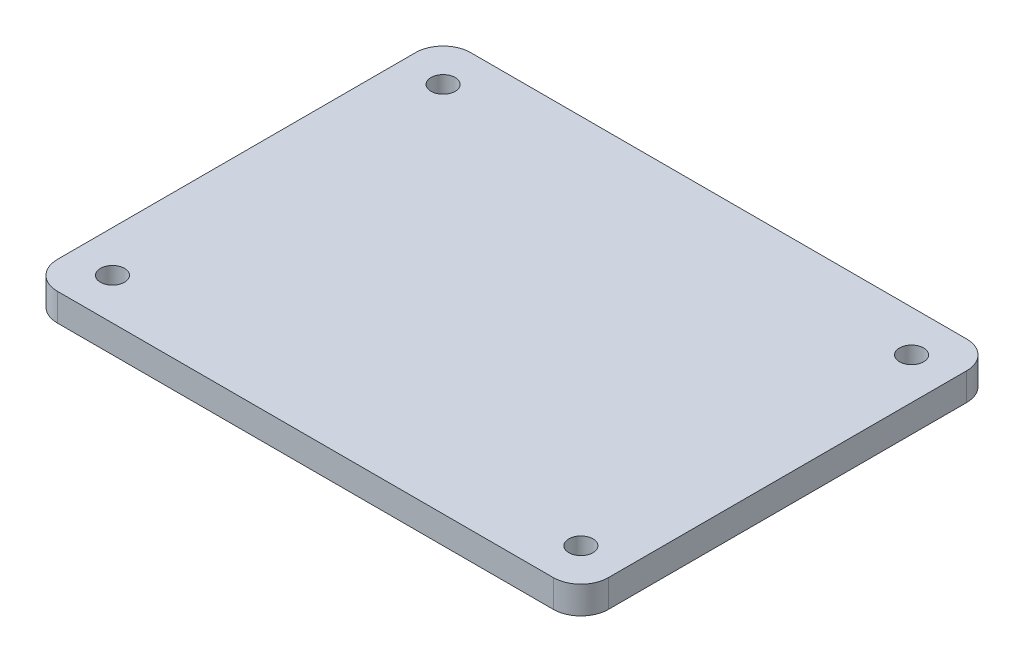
from build123d import *

# Parameters (mm, degrees)
SKIZZE1_R                       = 1.75
AUFSATZ_LINEAR_AUSTRAGEN1_DEPTH = 4


with BuildPart() as part:
    # Skizze1 → Aufsatz-Linear austragen1 (new body)
    with BuildSketch(Plane(origin=(0, 0, 0), x_dir=(1, 0, 0), z_dir=(0, 1, 0))):
        with BuildLine():
            Line((-36, 30), (36, 30))
            ThreePointArc((36, 30), (38.828427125, 28.828427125), (40, 26))
            Line((40, 26), (40, -26))
            ThreePointArc((40, -26), (38.828427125, -28.828427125), (36, -30))
            Line((36, -30), (-36, -30))
            ThreePointArc((-36, -30), (-38.828427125, -28.828427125), (-40, -26))
            Line((-40, -26), (-40, 26))
            ThreePointArc((-40, 26), (-38.828427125, 28.828427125), (-36, 30))
        make_face()
        with Locations(Location((-34, 24, 0), (0, 0, 270))):
            Circle(SKIZZE1_R, mode=Mode.SUBTRACT)
        with Locations(Location((34, 24, 0), (0, 0, 90))):
            Circle(SKIZZE1_R, mode=Mode.SUBTRACT)
        with Locations(Location((34, -24, 0), (0, 0, 270))):
            Circle(SKIZZE1_R, mode=Mode.SUBTRACT)
        with Locations(Location((-34, -24, 0), (0, 0, 90))):
            Circle(SKIZZE1_R, mode=Mode.SUBTRACT)
    extrude(amount=AUFSATZ_LINEAR_AUSTRAGEN1_DEPTH)


solid = part.part
